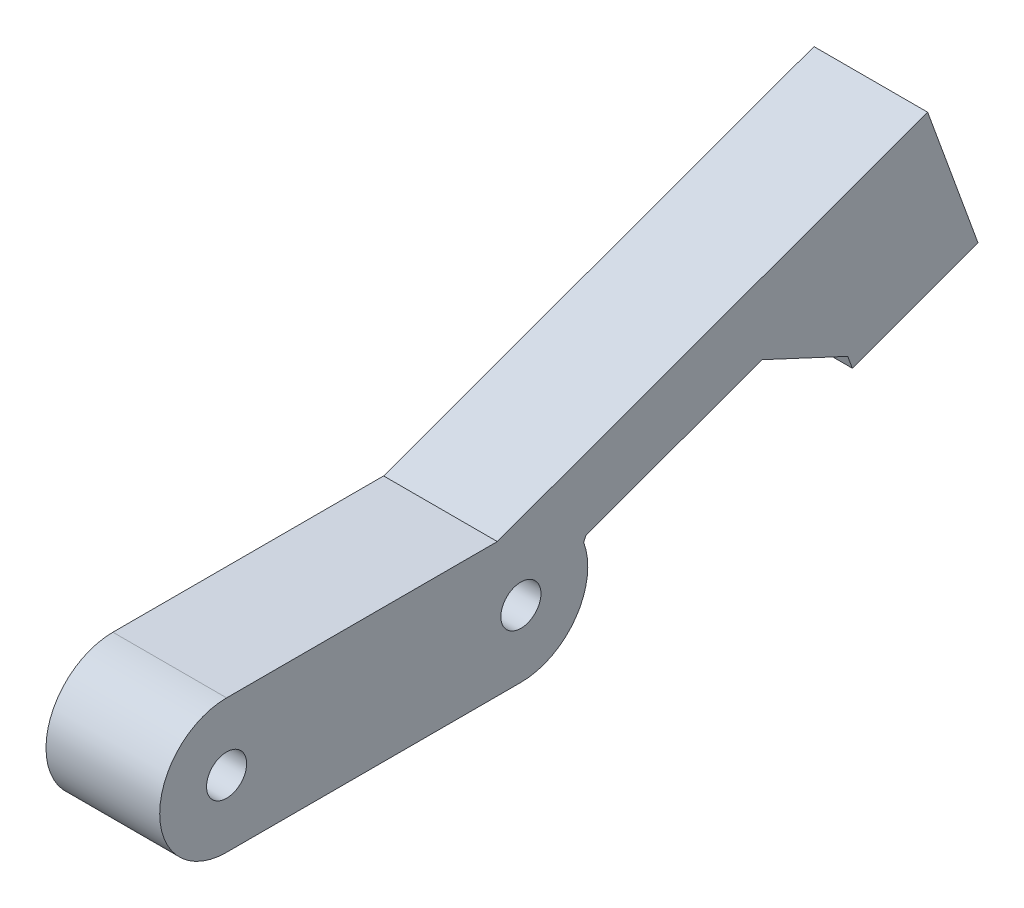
from build123d import *

# Parameters (mm, degrees)
SKETCH1_R           = 1.5
BOSS_EXTRUDE1_DEPTH = 8.5
BOSS_EXTRUDE2_START = -8.5
BOSS_EXTRUDE2_DEPTH = 8.5


with BuildPart() as part:
    # Sketch1 → Boss-Extrude1 (new body)
    with BuildSketch(Plane(origin=(0, 0, 0), x_dir=(0, 0, -1), z_dir=(1, 0, 0))):
        with BuildLine():
            Line((27, 10), (5, 10))
            ThreePointArc((5, 10), (0, 5), (5, 0))
            Line((5, 0), (27, 0))
            ThreePointArc((27, 0), (32, 5), (27, 10))
        make_face()
        with Locations((5, 5)):
            Circle(SKETCH1_R, mode=Mode.SUBTRACT)
        with Locations((27, 5)):
            Circle(SKETCH1_R, mode=Mode.SUBTRACT)
    extrude(amount=BOSS_EXTRUDE1_DEPTH)

    # Sketch2 → Boss-Extrude2 (add)
    with BuildSketch(Plane(origin=(8.5, 0, 0), x_dir=(0, 0, -1), z_dir=(1, 0, 0)).offset(BOSS_EXTRUDE2_START)):
        with BuildLine():
            ThreePointArc((27, 10), (29.863119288, 9.099091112), (31.69447473, 6.721019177))
            Line((31.69447473, 6.721019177), (31.867747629, 7.092604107))
            Line((31.867747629, 7.092604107), (45.02344432, 11.880886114))
            Line((45.02344432, 11.880886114), (51.43200814, 8.892523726))
            Line((51.43200814, 8.892523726), (60.828934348, 12.31272516))
            Line((60.828934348, 12.31272516), (57.408732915, 21.709651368))
            Line((57.408732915, 21.709651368), (25.236730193, 10))
            Line((25.236730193, 10), (27, 10))
        make_face()
        Polygon((60.828934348, 12.31272516), (51.43200814, 8.892523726), (51.774028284, 7.952831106), (61.170954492, 11.373032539), align=None)
    extrude(amount=BOSS_EXTRUDE2_DEPTH)


solid = part.part
